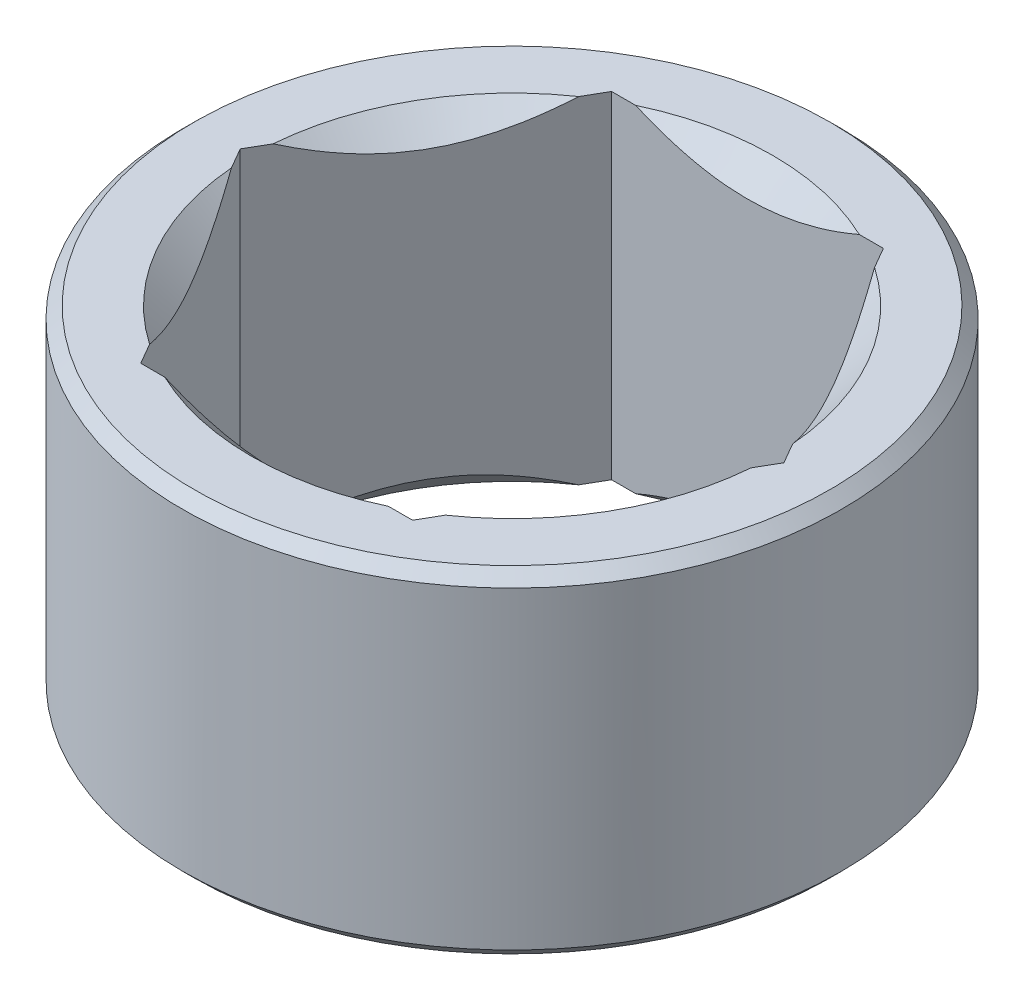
ISO-10303-21;
HEADER;
FILE_DESCRIPTION(('STEP AP214'),'2;1');
FILE_NAME('part.step','',(''),(''),'','','');
FILE_SCHEMA(('AUTOMOTIVE_DESIGN { 1 0 10303 214 1 1 1 1 }'));
ENDSEC;
DATA;
#1=APPLICATION_CONTEXT('core data for automotive mechanical design processes');
#2=APPLICATION_PROTOCOL_DEFINITION('international standard','automotive_design',2000,#1);
#3=PRODUCT_CONTEXT('',#1,'mechanical');
#4=PRODUCT('Part','Part','',(#3));
#5=PRODUCT_RELATED_PRODUCT_CATEGORY('part','',(#4));
#6=PRODUCT_DEFINITION_FORMATION('','',#4);
#7=PRODUCT_DEFINITION_CONTEXT('part definition',#1,'design');
#8=PRODUCT_DEFINITION('design','',#6,#7);
#9=PRODUCT_DEFINITION_SHAPE('','',#8);
#10=(LENGTH_UNIT() NAMED_UNIT(*) SI_UNIT(.MILLI.,.METRE.));
#11=(NAMED_UNIT(*) PLANE_ANGLE_UNIT() SI_UNIT($,.RADIAN.));
#12=(NAMED_UNIT(*) SI_UNIT($,.STERADIAN.) SOLID_ANGLE_UNIT());
#13=UNCERTAINTY_MEASURE_WITH_UNIT(LENGTH_MEASURE(1.E-05),#10,'distance_accuracy_value','');
#14=(GEOMETRIC_REPRESENTATION_CONTEXT(3) GLOBAL_UNCERTAINTY_ASSIGNED_CONTEXT((#13)) GLOBAL_UNIT_ASSIGNED_CONTEXT((#10,
#11,#12)) REPRESENTATION_CONTEXT('',''));
#15=CARTESIAN_POINT('',(0.,0.,0.));
#16=DIRECTION('',(0.,0.,1.));
#17=DIRECTION('',(1.,0.,0.));
#18=AXIS2_PLACEMENT_3D('',#15,#16,#17);
#19=CARTESIAN_POINT('',(3.03108891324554,-3.90512483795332,1.75));
#20=DIRECTION('',(0.866025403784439,0.,0.5));
#21=DIRECTION('',(0.5,0.,-0.866025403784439));
#22=AXIS2_PLACEMENT_3D('',#19,#20,#21);
#23=PLANE('',#22);
#24=DIRECTION('',(0.5,0.,-0.866025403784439));
#25=VECTOR('',#24,1.);
#26=CARTESIAN_POINT('',(3.03108891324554,0.,1.75));
#27=LINE('',#26,#25);
#28=CARTESIAN_POINT('',(2.02072594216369,0.,3.5));
#29=VERTEX_POINT('',#28);
#30=CARTESIAN_POINT('',(2.1995804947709,-3.3738490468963E-12,3.19021482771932));
#31=VERTEX_POINT('',#30);
#32=EDGE_CURVE('E440',#29,#31,#27,.T.);
#33=ORIENTED_EDGE('',*,*,#32,.F.);
#34=DIRECTION('',(0.,1.,0.));
#35=VECTOR('',#34,1.);
#36=CARTESIAN_POINT('',(2.02072594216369,-3.90512483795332,3.5));
#37=LINE('',#36,#35);
#38=CARTESIAN_POINT('',(2.02072594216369,5.,3.5));
#39=VERTEX_POINT('',#38);
#40=EDGE_CURVE('E434',#29,#39,#37,.T.);
#41=ORIENTED_EDGE('',*,*,#40,.T.);
#42=DIRECTION('',(0.5,0.,-0.866025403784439));
#43=VECTOR('',#42,1.);
#44=CARTESIAN_POINT('',(3.03108891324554,5.,1.75));
#45=LINE('',#44,#43);
#46=CARTESIAN_POINT('',(2.19958049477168,4.99999999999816,3.19021482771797));
#47=VERTEX_POINT('',#46);
#48=EDGE_CURVE('E444',#47,#39,#45,.F.);
#49=ORIENTED_EDGE('',*,*,#48,.F.);
#50=CARTESIAN_POINT('',(2.19958049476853,5.00000000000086,3.19021482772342));
#51=CARTESIAN_POINT('',(2.25988384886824,4.94823979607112,3.08576635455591));
#52=CARTESIAN_POINT('',(2.32109270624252,4.90029234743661,2.97974950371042));
#53=CARTESIAN_POINT('',(2.4453953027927,4.81397240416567,2.76445109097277));
#54=CARTESIAN_POINT('',(2.5084947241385,4.77563289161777,2.65515968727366));
#55=CARTESIAN_POINT('',(2.63555957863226,4.71120349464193,2.43507690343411));
#56=CARTESIAN_POINT('',(2.69950855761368,4.68498711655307,2.32431402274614));
#57=CARTESIAN_POINT('',(2.82835908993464,4.64611091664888,2.10113835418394));
#58=CARTESIAN_POINT('',(2.89325917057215,4.63343200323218,1.98872811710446));
#59=CARTESIAN_POINT('',(3.01955537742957,4.62293511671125,1.76997667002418));
#60=CARTESIAN_POINT('',(3.08093424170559,4.62429071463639,1.66366535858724));
#61=CARTESIAN_POINT('',(3.20331050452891,4.63978476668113,1.45170345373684));
#62=CARTESIAN_POINT('',(3.26430769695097,4.65392961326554,1.34605321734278));
#63=CARTESIAN_POINT('',(3.38527889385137,4.69397122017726,1.13652495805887));
#64=CARTESIAN_POINT('',(3.44525336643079,4.7198624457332,1.03264612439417));
#65=CARTESIAN_POINT('',(3.56387400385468,4.78181692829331,0.827189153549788));
#66=CARTESIAN_POINT('',(3.62251979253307,4.81788302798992,0.725611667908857));
#67=CARTESIAN_POINT('',(3.7112413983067,4.87960838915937,0.571941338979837));
#68=CARTESIAN_POINT('',(3.74185591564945,4.90225005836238,0.518915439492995));
#69=CARTESIAN_POINT('',(3.8025799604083,4.94961521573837,0.41373830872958));
#70=CARTESIAN_POINT('',(3.83269067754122,4.97433259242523,0.361585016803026));
#71=CARTESIAN_POINT('',(3.86259733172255,5.00000000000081,0.309785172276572));
#72=B_SPLINE_CURVE_WITH_KNOTS('',3,(#50,#51,#52,#53,#54,#55,#56,#57,#58,#59,#60,#61,#62,#63,#64,
#65,#66,#67,#68,#69,#70,#71),.UNSPECIFIED.,.F.,.F.,(4,2,2,2,2,2,2,2,2,2,4),(0.,
0.393910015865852,0.789154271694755,1.18017591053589,1.57064536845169,1.93825910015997,
2.30605667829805,2.67368113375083,3.04140839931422,3.23721815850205,3.43247035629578),.UNSPECIFIED.);
#73=CARTESIAN_POINT('',(3.8625973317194,4.99999999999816,0.309785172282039));
#74=VERTEX_POINT('',#73);
#75=EDGE_CURVE('E219',#47,#74,#72,.T.);
#76=ORIENTED_EDGE('',*,*,#75,.T.);
#77=DIRECTION('',(0.5,0.,-0.866025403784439));
#78=VECTOR('',#77,1.);
#79=CARTESIAN_POINT('',(3.03108891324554,5.,1.75));
#80=LINE('',#79,#78);
#81=CARTESIAN_POINT('',(4.04145188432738,5.00000000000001,0.));
#82=VERTEX_POINT('',#81);
#83=EDGE_CURVE('E449',#82,#74,#80,.F.);
#84=ORIENTED_EDGE('',*,*,#83,.F.);
#85=DIRECTION('',(0.,1.,0.));
#86=VECTOR('',#85,1.);
#87=CARTESIAN_POINT('',(4.04145188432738,-3.90512483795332,0.));
#88=LINE('',#87,#86);
#89=CARTESIAN_POINT('',(4.04145188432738,0.,0.));
#90=VERTEX_POINT('',#89);
#91=EDGE_CURVE('E359',#82,#90,#88,.F.);
#92=ORIENTED_EDGE('',*,*,#91,.T.);
#93=DIRECTION('',(0.5,0.,-0.866025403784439));
#94=VECTOR('',#93,1.);
#95=CARTESIAN_POINT('',(3.03108891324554,0.,1.75));
#96=LINE('',#95,#94);
#97=CARTESIAN_POINT('',(3.86259733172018,-3.37327958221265E-12,0.309785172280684));
#98=VERTEX_POINT('',#97);
#99=EDGE_CURVE('E357',#98,#90,#96,.T.);
#100=ORIENTED_EDGE('',*,*,#99,.F.);
#101=CARTESIAN_POINT('',(3.86259733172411,-6.74840878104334E-12,0.309785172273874));
#102=CARTESIAN_POINT('',(3.80229397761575,0.051760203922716,0.414233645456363));
#103=CARTESIAN_POINT('',(3.74108512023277,0.0997076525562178,0.520250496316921));
#104=CARTESIAN_POINT('',(3.61678252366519,0.186027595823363,0.735548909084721));
#105=CARTESIAN_POINT('',(3.55368310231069,0.224367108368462,0.844840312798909));
#106=CARTESIAN_POINT('',(3.42661824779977,0.288796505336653,1.06492309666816));
#107=CARTESIAN_POINT('',(3.36266926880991,0.315012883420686,1.17568597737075));
#108=CARTESIAN_POINT('',(3.23381873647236,0.35388908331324,1.39886164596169));
#109=CARTESIAN_POINT('',(3.16891865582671,0.366567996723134,1.51127188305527));
#110=CARTESIAN_POINT('',(3.04262244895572,0.377064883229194,1.73002333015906));
#111=CARTESIAN_POINT('',(2.98124358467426,0.375709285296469,1.83633464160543));
#112=CARTESIAN_POINT('',(2.85886732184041,0.360215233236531,2.04829654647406));
#113=CARTESIAN_POINT('',(2.79787012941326,0.346070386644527,2.15394678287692));
#114=CARTESIAN_POINT('',(2.67689893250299,0.306028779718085,2.36347504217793));
#115=CARTESIAN_POINT('',(2.61692445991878,0.28013755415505,2.46735387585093));
#116=CARTESIAN_POINT('',(2.49830382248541,0.218183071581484,2.67281084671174));
#117=CARTESIAN_POINT('',(2.43965803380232,0.182116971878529,2.7743883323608));
#118=CARTESIAN_POINT('',(2.35093642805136,0.120391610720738,2.92805866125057));
#119=CARTESIAN_POINT('',(2.32032191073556,0.0977499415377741,2.98108456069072));
#120=CARTESIAN_POINT('',(2.25959786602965,0.0503847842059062,3.08626169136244));
#121=CARTESIAN_POINT('',(2.22948714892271,0.0256674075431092,3.13841498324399));
#122=CARTESIAN_POINT('',(2.19958049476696,-6.70526278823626E-12,3.19021482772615));
#123=B_SPLINE_CURVE_WITH_KNOTS('',3,(#101,#102,#103,#104,#105,#106,#107,#108,#109,#110,#111,
#112,#113,#114,#115,#116,#117,#118,#119,#120,#121,#122),.UNSPECIFIED.,.F.,.F.,(4,2,2,2,2,2,2,2,
2,2,4),(0.,0.393910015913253,0.789154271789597,1.18017591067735,1.57064536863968,
1.9382591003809,2.30605667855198,2.67368113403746,3.04140839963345,3.23721815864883,
3.43247035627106),.UNSPECIFIED.);
#124=EDGE_CURVE('E251',#98,#31,#123,.T.);
#125=ORIENTED_EDGE('',*,*,#124,.T.);
#126=EDGE_LOOP('',(#33,#41,#49,#76,#84,#92,#100,#125));
#127=FACE_BOUND('',#126,.T.);
#128=ADVANCED_FACE('F16',(#127),#23,.F.);
#129=CARTESIAN_POINT('',(0.,-3.90512483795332,3.5));
#130=DIRECTION('',(0.,0.,1.));
#131=DIRECTION('',(1.,0.,0.));
#132=AXIS2_PLACEMENT_3D('',#129,#130,#131);
#133=PLANE('',#132);
#134=DIRECTION('',(1.,0.,0.));
#135=VECTOR('',#134,1.);
#136=CARTESIAN_POINT('',(0.,0.,3.5));
#137=LINE('',#136,#135);
#138=CARTESIAN_POINT('',(-2.02072594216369,0.,3.5));
#139=VERTEX_POINT('',#138);
#140=CARTESIAN_POINT('',(-1.66301683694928,-3.37238688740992E-12,3.5));
#141=VERTEX_POINT('',#140);
#142=EDGE_CURVE('E421',#139,#141,#137,.T.);
#143=ORIENTED_EDGE('',*,*,#142,.F.);
#144=DIRECTION('',(0.,1.,0.));
#145=VECTOR('',#144,1.);
#146=CARTESIAN_POINT('',(-2.02072594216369,-3.90512483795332,3.5));
#147=LINE('',#146,#145);
#148=CARTESIAN_POINT('',(-2.02072594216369,5.,3.5));
#149=VERTEX_POINT('',#148);
#150=EDGE_CURVE('E416',#139,#149,#147,.T.);
#151=ORIENTED_EDGE('',*,*,#150,.T.);
#152=DIRECTION('',(1.,0.,0.));
#153=VECTOR('',#152,1.);
#154=CARTESIAN_POINT('',(0.,5.,3.5));
#155=LINE('',#154,#153);
#156=CARTESIAN_POINT('',(-1.66301683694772,4.99999999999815,3.5));
#157=VERTEX_POINT('',#156);
#158=EDGE_CURVE('E425',#157,#149,#155,.F.);
#159=ORIENTED_EDGE('',*,*,#158,.F.);
#160=CARTESIAN_POINT('',(-1.66301683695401,5.00000000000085,3.5));
#161=CARTESIAN_POINT('',(-1.5424101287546,4.94823979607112,3.5));
#162=CARTESIAN_POINT('',(-1.41999241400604,4.90029234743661,3.5));
#163=CARTESIAN_POINT('',(-1.17138722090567,4.81397240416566,3.5));
#164=CARTESIAN_POINT('',(-1.04518837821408,4.77563289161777,3.5));
#165=CARTESIAN_POINT('',(-0.79105866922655,4.71120349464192,3.5));
#166=CARTESIAN_POINT('',(-0.663160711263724,4.68498711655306,3.5));
#167=CARTESIAN_POINT('',(-0.405459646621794,4.64611091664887,3.5));
#168=CARTESIAN_POINT('',(-0.275659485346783,4.63343200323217,3.5));
#169=CARTESIAN_POINT('',(-0.0230670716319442,4.62293511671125,3.5));
#170=CARTESIAN_POINT('',(0.0996906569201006,4.62429071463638,3.5));
#171=CARTESIAN_POINT('',(0.344443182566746,4.63978476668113,3.5));
#172=CARTESIAN_POINT('',(0.466437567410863,4.65392961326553,3.5));
#173=CARTESIAN_POINT('',(0.70837996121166,4.69397122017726,3.5));
#174=CARTESIAN_POINT('',(0.828328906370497,4.71986244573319,3.5));
#175=CARTESIAN_POINT('',(1.06557018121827,4.78181692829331,3.5));
#176=CARTESIAN_POINT('',(1.18286175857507,4.81788302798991,3.5));
#177=CARTESIAN_POINT('',(1.36030497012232,4.87960838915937,3.5));
#178=CARTESIAN_POINT('',(1.42153400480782,4.90225005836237,3.5));
#179=CARTESIAN_POINT('',(1.54298209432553,4.94961521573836,3.5));
#180=CARTESIAN_POINT('',(1.60320352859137,4.97433259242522,3.5));
#181=CARTESIAN_POINT('',(1.66301683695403,5.00000000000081,3.5));
#182=B_SPLINE_CURVE_WITH_KNOTS('',3,(#160,#161,#162,#163,#164,#165,#166,#167,#168,#169,#170,
#171,#172,#173,#174,#175,#176,#177,#178,#179,#180,#181),.UNSPECIFIED.,.F.,.F.,(4,2,2,2,2,2,2,2,
2,2,4),(0.,0.39391001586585,0.789154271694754,1.18017591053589,1.57064536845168,
1.93825910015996,2.30605667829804,2.67368113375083,3.04140839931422,3.23721815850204,
3.43247035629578),.UNSPECIFIED.);
#183=CARTESIAN_POINT('',(1.66301683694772,4.99999999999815,3.5));
#184=VERTEX_POINT('',#183);
#185=EDGE_CURVE('E488',#157,#184,#182,.T.);
#186=ORIENTED_EDGE('',*,*,#185,.T.);
#187=DIRECTION('',(1.,0.,0.));
#188=VECTOR('',#187,1.);
#189=CARTESIAN_POINT('',(0.,5.,3.5));
#190=LINE('',#189,#188);
#191=EDGE_CURVE('E430',#39,#184,#190,.F.);
#192=ORIENTED_EDGE('',*,*,#191,.F.);
#193=ORIENTED_EDGE('',*,*,#40,.F.);
#194=DIRECTION('',(1.,0.,0.));
#195=VECTOR('',#194,1.);
#196=CARTESIAN_POINT('',(0.,0.,3.5));
#197=LINE('',#196,#195);
#198=CARTESIAN_POINT('',(1.66301683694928,-3.37235223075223E-12,3.5));
#199=VERTEX_POINT('',#198);
#200=EDGE_CURVE('E437',#199,#29,#197,.T.);
#201=ORIENTED_EDGE('',*,*,#200,.F.);
#202=CARTESIAN_POINT('',(1.66301683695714,-6.74520497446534E-12,3.5));
#203=CARTESIAN_POINT('',(1.54241012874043,0.0517602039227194,3.5));
#204=CARTESIAN_POINT('',(1.41999241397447,0.099707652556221,3.5));
#205=CARTESIAN_POINT('',(1.17138722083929,0.186027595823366,3.5));
#206=CARTESIAN_POINT('',(1.04518837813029,0.224367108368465,3.5));
#207=CARTESIAN_POINT('',(0.791058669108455,0.288796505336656,3.5));
#208=CARTESIAN_POINT('',(0.663160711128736,0.315012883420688,3.5));
#209=CARTESIAN_POINT('',(0.405459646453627,0.353889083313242,3.5));
#210=CARTESIAN_POINT('',(0.275659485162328,0.366567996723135,3.5));
#211=CARTESIAN_POINT('',(0.0230670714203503,0.377064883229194,3.5));
#212=CARTESIAN_POINT('',(-0.0996906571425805,0.375709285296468,3.5));
#213=CARTESIAN_POINT('',(-0.344443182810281,0.36021523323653,3.5));
#214=CARTESIAN_POINT('',(-0.466437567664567,0.346070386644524,3.5));
#215=CARTESIAN_POINT('',(-0.708379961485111,0.306028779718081,3.5));
#216=CARTESIAN_POINT('',(-0.828328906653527,0.280137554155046,3.5));
#217=CARTESIAN_POINT('',(-1.06557018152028,0.218183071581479,3.5));
#218=CARTESIAN_POINT('',(-1.18286175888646,0.182116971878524,3.5));
#219=CARTESIAN_POINT('',(-1.36030497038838,0.120391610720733,3.5));
#220=CARTESIAN_POINT('',(-1.42153400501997,0.097749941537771,3.5));
#221=CARTESIAN_POINT('',(-1.54298209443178,0.0503847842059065,3.5));
#222=CARTESIAN_POINT('',(-1.60320352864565,0.0256674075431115,3.5));
#223=CARTESIAN_POINT('',(-1.66301683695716,-6.70062350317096E-12,3.5));
#224=B_SPLINE_CURVE_WITH_KNOTS('',3,(#202,#203,#204,#205,#206,#207,#208,#209,#210,#211,#212,
#213,#214,#215,#216,#217,#218,#219,#220,#221,#222,#223),.UNSPECIFIED.,.F.,.F.,(4,2,2,2,2,2,2,2,
2,2,4),(0.,0.393910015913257,0.789154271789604,1.18017591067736,1.5706453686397,
1.93825910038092,2.306056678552,2.67368113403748,3.04140839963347,3.23721815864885,
3.43247035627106),.UNSPECIFIED.);
#225=EDGE_CURVE('E220',#199,#141,#224,.T.);
#226=ORIENTED_EDGE('',*,*,#225,.T.);
#227=EDGE_LOOP('',(#143,#151,#159,#186,#192,#193,#201,#226));
#228=FACE_BOUND('',#227,.T.);
#229=ADVANCED_FACE('F205',(#228),#133,.F.);
#230=CARTESIAN_POINT('',(-3.03108891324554,-3.90512483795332,1.75));
#231=DIRECTION('',(-0.866025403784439,0.,0.5));
#232=DIRECTION('',(0.5,0.,0.866025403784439));
#233=AXIS2_PLACEMENT_3D('',#230,#231,#232);
#234=PLANE('',#233);
#235=DIRECTION('',(0.5,0.,0.866025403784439));
#236=VECTOR('',#235,1.);
#237=CARTESIAN_POINT('',(-3.03108891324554,0.,1.75));
#238=LINE('',#237,#236);
#239=CARTESIAN_POINT('',(-4.04145188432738,0.,0.));
#240=VERTEX_POINT('',#239);
#241=CARTESIAN_POINT('',(-3.86259733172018,-3.37555176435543E-12,0.30978517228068));
#242=VERTEX_POINT('',#241);
#243=EDGE_CURVE('E403',#240,#242,#238,.T.);
#244=ORIENTED_EDGE('',*,*,#243,.F.);
#245=DIRECTION('',(0.,1.,0.));
#246=VECTOR('',#245,1.);
#247=CARTESIAN_POINT('',(-4.04145188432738,-3.90512483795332,0.));
#248=LINE('',#247,#246);
#249=CARTESIAN_POINT('',(-4.04145188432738,5.,0.));
#250=VERTEX_POINT('',#249);
#251=EDGE_CURVE('E399',#240,#250,#248,.T.);
#252=ORIENTED_EDGE('',*,*,#251,.T.);
#253=DIRECTION('',(0.5,0.,0.866025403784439));
#254=VECTOR('',#253,1.);
#255=CARTESIAN_POINT('',(-3.03108891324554,5.,1.75));
#256=LINE('',#255,#254);
#257=CARTESIAN_POINT('',(-3.8625973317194,4.99999999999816,0.309785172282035));
#258=VERTEX_POINT('',#257);
#259=EDGE_CURVE('E407',#258,#250,#256,.F.);
#260=ORIENTED_EDGE('',*,*,#259,.F.);
#261=CARTESIAN_POINT('',(-3.86259733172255,5.00000000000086,0.309785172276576));
#262=CARTESIAN_POINT('',(-3.80229397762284,4.94823979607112,0.414233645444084));
#263=CARTESIAN_POINT('',(-3.74108512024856,4.90029234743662,0.520250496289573));
#264=CARTESIAN_POINT('',(-3.61678252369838,4.81397240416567,0.735548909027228));
#265=CARTESIAN_POINT('',(-3.55368310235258,4.77563289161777,0.84484031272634));
#266=CARTESIAN_POINT('',(-3.42661824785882,4.71120349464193,1.06492309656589));
#267=CARTESIAN_POINT('',(-3.3626692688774,4.68498711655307,1.17568597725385));
#268=CARTESIAN_POINT('',(-3.23381873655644,4.64611091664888,1.39886164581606));
#269=CARTESIAN_POINT('',(-3.16891865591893,4.63343200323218,1.51127188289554));
#270=CARTESIAN_POINT('',(-3.04262244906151,4.62293511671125,1.73002332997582));
#271=CARTESIAN_POINT('',(-2.98124358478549,4.62429071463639,1.83633464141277));
#272=CARTESIAN_POINT('',(-2.85886732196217,4.63978476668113,2.04829654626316));
#273=CARTESIAN_POINT('',(-2.79787012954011,4.65392961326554,2.15394678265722));
#274=CARTESIAN_POINT('',(-2.67689893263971,4.69397122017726,2.36347504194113));
#275=CARTESIAN_POINT('',(-2.61692446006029,4.7198624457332,2.46735387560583));
#276=CARTESIAN_POINT('',(-2.4983038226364,4.78181692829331,2.67281084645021));
#277=CARTESIAN_POINT('',(-2.43965803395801,4.81788302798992,2.77438833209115));
#278=CARTESIAN_POINT('',(-2.35093642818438,4.87960838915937,2.92805866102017));
#279=CARTESIAN_POINT('',(-2.32032191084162,4.90225005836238,2.98108456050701));
#280=CARTESIAN_POINT('',(-2.25959786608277,4.94961521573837,3.08626169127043));
#281=CARTESIAN_POINT('',(-2.22948714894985,4.97433259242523,3.13841498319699));
#282=CARTESIAN_POINT('',(-2.19958049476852,5.00000000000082,3.19021482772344));
#283=B_SPLINE_CURVE_WITH_KNOTS('',3,(#261,#262,#263,#264,#265,#266,#267,#268,#269,#270,#271,
#272,#273,#274,#275,#276,#277,#278,#279,#280,#281,#282),.UNSPECIFIED.,.F.,.F.,(4,2,2,2,2,2,2,2,
2,2,4),(0.,0.393910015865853,0.789154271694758,1.1801759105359,1.57064536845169,
1.93825910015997,2.30605667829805,2.67368113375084,3.04140839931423,3.23721815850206,
3.4324703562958),.UNSPECIFIED.);
#284=CARTESIAN_POINT('',(-2.19958049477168,4.99999999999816,3.19021482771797));
#285=VERTEX_POINT('',#284);
#286=EDGE_CURVE('E190',#258,#285,#283,.T.);
#287=ORIENTED_EDGE('',*,*,#286,.T.);
#288=DIRECTION('',(0.5,0.,0.866025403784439));
#289=VECTOR('',#288,1.);
#290=CARTESIAN_POINT('',(-3.03108891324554,5.,1.75));
#291=LINE('',#290,#289);
#292=EDGE_CURVE('E412',#149,#285,#291,.F.);
#293=ORIENTED_EDGE('',*,*,#292,.F.);
#294=ORIENTED_EDGE('',*,*,#150,.F.);
#295=DIRECTION('',(0.5,0.,0.866025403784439));
#296=VECTOR('',#295,1.);
#297=CARTESIAN_POINT('',(-3.03108891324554,0.,1.75));
#298=LINE('',#297,#296);
#299=CARTESIAN_POINT('',(-2.1995804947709,-3.37625537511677E-12,3.19021482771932));
#300=VERTEX_POINT('',#299);
#301=EDGE_CURVE('E419',#300,#139,#298,.T.);
#302=ORIENTED_EDGE('',*,*,#301,.F.);
#303=CARTESIAN_POINT('',(-2.19958049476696,-6.75440851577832E-12,3.19021482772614));
#304=CARTESIAN_POINT('',(-2.25988384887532,0.051760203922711,3.08576635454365));
#305=CARTESIAN_POINT('',(-2.3210927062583,0.0997076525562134,2.97974950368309));
#306=CARTESIAN_POINT('',(-2.44539530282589,0.18602759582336,2.76445109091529));
#307=CARTESIAN_POINT('',(-2.50849472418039,0.224367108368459,2.6551596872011));
#308=CARTESIAN_POINT('',(-2.6355595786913,0.288796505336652,2.43507690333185));
#309=CARTESIAN_POINT('',(-2.69950855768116,0.315012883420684,2.32431402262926));
#310=CARTESIAN_POINT('',(-2.82835909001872,0.35388908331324,2.10113835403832));
#311=CARTESIAN_POINT('',(-2.89325917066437,0.366567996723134,1.98872811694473));
#312=CARTESIAN_POINT('',(-3.01955537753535,0.377064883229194,1.76997666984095));
#313=CARTESIAN_POINT('',(-3.08093424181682,0.375709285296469,1.66366535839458));
#314=CARTESIAN_POINT('',(-3.20331050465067,0.360215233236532,1.45170345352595));
#315=CARTESIAN_POINT('',(-3.26430769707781,0.346070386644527,1.34605321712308));
#316=CARTESIAN_POINT('',(-3.38527889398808,0.306028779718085,1.13652495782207));
#317=CARTESIAN_POINT('',(-3.44525336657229,0.280137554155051,1.03264612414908));
#318=CARTESIAN_POINT('',(-3.56387400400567,0.218183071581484,0.827189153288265));
#319=CARTESIAN_POINT('',(-3.62251979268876,0.182116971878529,0.725611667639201));
#320=CARTESIAN_POINT('',(-3.71124139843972,0.120391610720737,0.571941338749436));
#321=CARTESIAN_POINT('',(-3.74185591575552,0.0977499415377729,0.518915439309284));
#322=CARTESIAN_POINT('',(-3.80257996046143,0.0503847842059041,0.41373830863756));
#323=CARTESIAN_POINT('',(-3.83269067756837,0.0256674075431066,0.361585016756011));
#324=CARTESIAN_POINT('',(-3.86259733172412,-6.70837451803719E-12,0.309785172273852));
#325=B_SPLINE_CURVE_WITH_KNOTS('',3,(#303,#304,#305,#306,#307,#308,#309,#310,#311,#312,#313,
#314,#315,#316,#317,#318,#319,#320,#321,#322,#323,#324),.UNSPECIFIED.,.F.,.F.,(4,2,2,2,2,2,2,2,
2,2,4),(0.,0.393910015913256,0.789154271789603,1.18017591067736,1.57064536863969,
1.93825910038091,2.30605667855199,2.67368113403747,3.04140839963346,3.23721815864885,
3.43247035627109),.UNSPECIFIED.);
#326=EDGE_CURVE('E210',#300,#242,#325,.T.);
#327=ORIENTED_EDGE('',*,*,#326,.T.);
#328=EDGE_LOOP('',(#244,#252,#260,#287,#293,#294,#302,#327));
#329=FACE_BOUND('',#328,.T.);
#330=ADVANCED_FACE('F200',(#329),#234,.F.);
#331=CARTESIAN_POINT('',(-3.03108891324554,-3.90512483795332,-1.75));
#332=DIRECTION('',(-0.866025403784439,0.,-0.5));
#333=DIRECTION('',(-0.5,0.,0.866025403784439));
#334=AXIS2_PLACEMENT_3D('',#331,#332,#333);
#335=PLANE('',#334);
#336=DIRECTION('',(-0.5,0.,0.866025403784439));
#337=VECTOR('',#336,1.);
#338=CARTESIAN_POINT('',(-3.03108891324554,0.,-1.75));
#339=LINE('',#338,#337);
#340=CARTESIAN_POINT('',(-2.02072594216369,0.,-3.5));
#341=VERTEX_POINT('',#340);
#342=CARTESIAN_POINT('',(-2.1995804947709,-3.37643465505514E-12,-3.19021482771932));
#343=VERTEX_POINT('',#342);
#344=EDGE_CURVE('E121',#341,#343,#339,.T.);
#345=ORIENTED_EDGE('',*,*,#344,.F.);
#346=DIRECTION('',(0.,1.,0.));
#347=VECTOR('',#346,1.);
#348=CARTESIAN_POINT('',(-2.02072594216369,-3.90512483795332,-3.5));
#349=LINE('',#348,#347);
#350=CARTESIAN_POINT('',(-2.02072594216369,5.,-3.5));
#351=VERTEX_POINT('',#350);
#352=EDGE_CURVE('E385',#341,#351,#349,.T.);
#353=ORIENTED_EDGE('',*,*,#352,.T.);
#354=DIRECTION('',(-0.5,0.,0.866025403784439));
#355=VECTOR('',#354,1.);
#356=CARTESIAN_POINT('',(-3.03108891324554,5.,-1.75));
#357=LINE('',#356,#355);
#358=CARTESIAN_POINT('',(-2.19958049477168,4.99999999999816,-3.19021482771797));
#359=VERTEX_POINT('',#358);
#360=EDGE_CURVE('E132',#359,#351,#357,.F.);
#361=ORIENTED_EDGE('',*,*,#360,.F.);
#362=CARTESIAN_POINT('',(-2.19958049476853,5.00000000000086,-3.19021482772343));
#363=CARTESIAN_POINT('',(-2.25988384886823,4.94823979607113,-3.08576635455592));
#364=CARTESIAN_POINT('',(-2.32109270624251,4.90029234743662,-2.97974950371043));
#365=CARTESIAN_POINT('',(-2.4453953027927,4.81397240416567,-2.76445109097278));
#366=CARTESIAN_POINT('',(-2.50849472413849,4.77563289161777,-2.65515968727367));
#367=CARTESIAN_POINT('',(-2.63555957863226,4.71120349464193,-2.43507690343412));
#368=CARTESIAN_POINT('',(-2.69950855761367,4.68498711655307,-2.32431402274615));
#369=CARTESIAN_POINT('',(-2.82835908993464,4.64611091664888,-2.10113835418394));
#370=CARTESIAN_POINT('',(-2.89325917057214,4.63343200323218,-1.98872811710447));
#371=CARTESIAN_POINT('',(-3.01955537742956,4.62293511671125,-1.76997667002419));
#372=CARTESIAN_POINT('',(-3.08093424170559,4.62429071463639,-1.66366535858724));
#373=CARTESIAN_POINT('',(-3.20331050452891,4.63978476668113,-1.45170345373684));
#374=CARTESIAN_POINT('',(-3.26430769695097,4.65392961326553,-1.34605321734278));
#375=CARTESIAN_POINT('',(-3.38527889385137,4.69397122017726,-1.13652495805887));
#376=CARTESIAN_POINT('',(-3.44525336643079,4.7198624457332,-1.03264612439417));
#377=CARTESIAN_POINT('',(-3.56387400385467,4.78181692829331,-0.827189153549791));
#378=CARTESIAN_POINT('',(-3.62251979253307,4.81788302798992,-0.72561166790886));
#379=CARTESIAN_POINT('',(-3.7112413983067,4.87960838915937,-0.571941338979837));
#380=CARTESIAN_POINT('',(-3.74185591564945,4.90225005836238,-0.518915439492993));
#381=CARTESIAN_POINT('',(-3.8025799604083,4.94961521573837,-0.413738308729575));
#382=CARTESIAN_POINT('',(-3.83269067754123,4.97433259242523,-0.361585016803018));
#383=CARTESIAN_POINT('',(-3.86259733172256,5.00000000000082,-0.309785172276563));
#384=B_SPLINE_CURVE_WITH_KNOTS('',3,(#362,#363,#364,#365,#366,#367,#368,#369,#370,#371,#372,
#373,#374,#375,#376,#377,#378,#379,#380,#381,#382,#383),.UNSPECIFIED.,.F.,.F.,(4,2,2,2,2,2,2,2,
2,2,4),(0.,0.393910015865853,0.789154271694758,1.1801759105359,1.57064536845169,
1.93825910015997,2.30605667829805,2.67368113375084,3.04140839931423,3.23721815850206,
3.43247035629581),.UNSPECIFIED.);
#385=CARTESIAN_POINT('',(-3.8625973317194,4.99999999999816,-0.309785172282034));
#386=VERTEX_POINT('',#385);
#387=EDGE_CURVE('E183',#359,#386,#384,.T.);
#388=ORIENTED_EDGE('',*,*,#387,.T.);
#389=DIRECTION('',(-0.5,0.,0.866025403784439));
#390=VECTOR('',#389,1.);
#391=CARTESIAN_POINT('',(-3.03108891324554,5.,-1.75));
#392=LINE('',#391,#390);
#393=EDGE_CURVE('E395',#250,#386,#392,.F.);
#394=ORIENTED_EDGE('',*,*,#393,.F.);
#395=ORIENTED_EDGE('',*,*,#251,.F.);
#396=DIRECTION('',(-0.5,0.,0.866025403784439));
#397=VECTOR('',#396,1.);
#398=CARTESIAN_POINT('',(-3.03108891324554,0.,-1.75));
#399=LINE('',#398,#397);
#400=CARTESIAN_POINT('',(-3.86259733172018,-3.37596011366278E-12,-0.309785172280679));
#401=VERTEX_POINT('',#400);
#402=EDGE_CURVE('E114',#401,#240,#399,.T.);
#403=ORIENTED_EDGE('',*,*,#402,.F.);
#404=CARTESIAN_POINT('',(-3.86259733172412,-6.75366592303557E-12,-0.309785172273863));
#405=CARTESIAN_POINT('',(-3.80229397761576,0.0517602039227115,-0.414233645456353));
#406=CARTESIAN_POINT('',(-3.74108512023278,0.0997076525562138,-0.520250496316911));
#407=CARTESIAN_POINT('',(-3.61678252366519,0.18602759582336,-0.735548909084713));
#408=CARTESIAN_POINT('',(-3.55368310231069,0.22436710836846,-0.844840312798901));
#409=CARTESIAN_POINT('',(-3.42661824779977,0.288796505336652,-1.06492309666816));
#410=CARTESIAN_POINT('',(-3.36266926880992,0.315012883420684,-1.17568597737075));
#411=CARTESIAN_POINT('',(-3.23381873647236,0.35388908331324,-1.39886164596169));
#412=CARTESIAN_POINT('',(-3.16891865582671,0.366567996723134,-1.51127188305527));
#413=CARTESIAN_POINT('',(-3.04262244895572,0.377064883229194,-1.73002333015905));
#414=CARTESIAN_POINT('',(-2.98124358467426,0.375709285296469,-1.83633464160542));
#415=CARTESIAN_POINT('',(-2.85886732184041,0.360215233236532,-2.04829654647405));
#416=CARTESIAN_POINT('',(-2.79787012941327,0.346070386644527,-2.15394678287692));
#417=CARTESIAN_POINT('',(-2.67689893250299,0.306028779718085,-2.36347504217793));
#418=CARTESIAN_POINT('',(-2.61692445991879,0.280137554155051,-2.46735387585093));
#419=CARTESIAN_POINT('',(-2.49830382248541,0.218183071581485,-2.67281084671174));
#420=CARTESIAN_POINT('',(-2.43965803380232,0.182116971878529,-2.7743883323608));
#421=CARTESIAN_POINT('',(-2.35093642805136,0.120391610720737,-2.92805866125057));
#422=CARTESIAN_POINT('',(-2.32032191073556,0.0977499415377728,-2.98108456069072));
#423=CARTESIAN_POINT('',(-2.25959786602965,0.0503847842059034,-3.08626169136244));
#424=CARTESIAN_POINT('',(-2.22948714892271,0.0256674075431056,-3.13841498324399));
#425=CARTESIAN_POINT('',(-2.19958049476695,-6.70987304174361E-12,-3.19021482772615));
#426=B_SPLINE_CURVE_WITH_KNOTS('',3,(#404,#405,#406,#407,#408,#409,#410,#411,#412,#413,#414,
#415,#416,#417,#418,#419,#420,#421,#422,#423,#424,#425),.UNSPECIFIED.,.F.,.F.,(4,2,2,2,2,2,2,2,
2,2,4),(0.,0.393910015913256,0.789154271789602,1.18017591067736,1.57064536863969,
1.93825910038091,2.30605667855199,2.67368113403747,3.04140839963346,3.23721815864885,
3.43247035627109),.UNSPECIFIED.);
#427=EDGE_CURVE('E20',#401,#343,#426,.T.);
#428=ORIENTED_EDGE('',*,*,#427,.T.);
#429=EDGE_LOOP('',(#345,#353,#361,#388,#394,#395,#403,#428));
#430=FACE_BOUND('',#429,.T.);
#431=ADVANCED_FACE('F134',(#430),#335,.F.);
#432=CARTESIAN_POINT('',(0.,-3.90512483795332,-3.5));
#433=DIRECTION('',(0.,0.,-1.));
#434=DIRECTION('',(-1.,0.,0.));
#435=AXIS2_PLACEMENT_3D('',#432,#433,#434);
#436=PLANE('',#435);
#437=DIRECTION('',(-1.,0.,0.));
#438=VECTOR('',#437,1.);
#439=CARTESIAN_POINT('',(0.,0.,-3.5));
#440=LINE('',#439,#438);
#441=CARTESIAN_POINT('',(2.02072594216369,0.,-3.5));
#442=VERTEX_POINT('',#441);
#443=CARTESIAN_POINT('',(1.66301683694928,-3.37238688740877E-12,-3.5));
#444=VERTEX_POINT('',#443);
#445=EDGE_CURVE('E365',#442,#444,#440,.T.);
#446=ORIENTED_EDGE('',*,*,#445,.F.);
#447=DIRECTION('',(0.,1.,0.));
#448=VECTOR('',#447,1.);
#449=CARTESIAN_POINT('',(2.02072594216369,-3.90512483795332,-3.5));
#450=LINE('',#449,#448);
#451=CARTESIAN_POINT('',(2.02072594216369,5.,-3.5));
#452=VERTEX_POINT('',#451);
#453=EDGE_CURVE('E364',#442,#452,#450,.T.);
#454=ORIENTED_EDGE('',*,*,#453,.T.);
#455=DIRECTION('',(-1.,0.,0.));
#456=VECTOR('',#455,1.);
#457=CARTESIAN_POINT('',(0.,5.,-3.5));
#458=LINE('',#457,#456);
#459=CARTESIAN_POINT('',(1.66301683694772,4.99999999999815,-3.5));
#460=VERTEX_POINT('',#459);
#461=EDGE_CURVE('E369',#460,#452,#458,.F.);
#462=ORIENTED_EDGE('',*,*,#461,.F.);
#463=CARTESIAN_POINT('',(1.66301683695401,5.00000000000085,-3.5));
#464=CARTESIAN_POINT('',(1.5424101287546,4.94823979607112,-3.5));
#465=CARTESIAN_POINT('',(1.41999241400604,4.90029234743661,-3.5));
#466=CARTESIAN_POINT('',(1.17138722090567,4.81397240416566,-3.5));
#467=CARTESIAN_POINT('',(1.04518837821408,4.77563289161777,-3.5));
#468=CARTESIAN_POINT('',(0.79105866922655,4.71120349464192,-3.5));
#469=CARTESIAN_POINT('',(0.663160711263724,4.68498711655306,-3.5));
#470=CARTESIAN_POINT('',(0.405459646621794,4.64611091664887,-3.5));
#471=CARTESIAN_POINT('',(0.275659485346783,4.63343200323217,-3.5));
#472=CARTESIAN_POINT('',(0.0230670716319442,4.62293511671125,-3.5));
#473=CARTESIAN_POINT('',(-0.0996906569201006,4.62429071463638,-3.5));
#474=CARTESIAN_POINT('',(-0.344443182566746,4.63978476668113,-3.5));
#475=CARTESIAN_POINT('',(-0.466437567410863,4.65392961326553,-3.5));
#476=CARTESIAN_POINT('',(-0.70837996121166,4.69397122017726,-3.5));
#477=CARTESIAN_POINT('',(-0.828328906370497,4.71986244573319,-3.5));
#478=CARTESIAN_POINT('',(-1.06557018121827,4.78181692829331,-3.5));
#479=CARTESIAN_POINT('',(-1.18286175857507,4.81788302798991,-3.5));
#480=CARTESIAN_POINT('',(-1.36030497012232,4.87960838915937,-3.5));
#481=CARTESIAN_POINT('',(-1.42153400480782,4.90225005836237,-3.5));
#482=CARTESIAN_POINT('',(-1.54298209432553,4.94961521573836,-3.5));
#483=CARTESIAN_POINT('',(-1.60320352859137,4.97433259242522,-3.5));
#484=CARTESIAN_POINT('',(-1.66301683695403,5.00000000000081,-3.5));
#485=B_SPLINE_CURVE_WITH_KNOTS('',3,(#463,#464,#465,#466,#467,#468,#469,#470,#471,#472,#473,
#474,#475,#476,#477,#478,#479,#480,#481,#482,#483,#484),.UNSPECIFIED.,.F.,.F.,(4,2,2,2,2,2,2,2,
2,2,4),(0.,0.39391001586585,0.789154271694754,1.18017591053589,1.57064536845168,
1.93825910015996,2.30605667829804,2.67368113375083,3.04140839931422,3.23721815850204,
3.43247035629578),.UNSPECIFIED.);
#486=CARTESIAN_POINT('',(-1.66301683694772,4.99999999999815,-3.5));
#487=VERTEX_POINT('',#486);
#488=EDGE_CURVE('E145',#460,#487,#485,.T.);
#489=ORIENTED_EDGE('',*,*,#488,.T.);
#490=DIRECTION('',(-1.,0.,0.));
#491=VECTOR('',#490,1.);
#492=CARTESIAN_POINT('',(0.,5.,-3.5));
#493=LINE('',#492,#491);
#494=EDGE_CURVE('E381',#351,#487,#493,.F.);
#495=ORIENTED_EDGE('',*,*,#494,.F.);
#496=ORIENTED_EDGE('',*,*,#352,.F.);
#497=DIRECTION('',(-1.,0.,0.));
#498=VECTOR('',#497,1.);
#499=CARTESIAN_POINT('',(0.,0.,-3.5));
#500=LINE('',#499,#498);
#501=CARTESIAN_POINT('',(-1.66301683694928,-3.37235223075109E-12,-3.5));
#502=VERTEX_POINT('',#501);
#503=EDGE_CURVE('E129',#502,#341,#500,.T.);
#504=ORIENTED_EDGE('',*,*,#503,.F.);
#505=CARTESIAN_POINT('',(-1.66301683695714,-6.74520497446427E-12,-3.5));
#506=CARTESIAN_POINT('',(-1.54241012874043,0.0517602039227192,-3.5));
#507=CARTESIAN_POINT('',(-1.41999241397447,0.0997076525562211,-3.5));
#508=CARTESIAN_POINT('',(-1.17138722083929,0.186027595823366,-3.5));
#509=CARTESIAN_POINT('',(-1.0451883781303,0.224367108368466,-3.5));
#510=CARTESIAN_POINT('',(-0.791058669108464,0.288796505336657,-3.5));
#511=CARTESIAN_POINT('',(-0.663160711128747,0.315012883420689,-3.5));
#512=CARTESIAN_POINT('',(-0.40545964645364,0.353889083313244,-3.5));
#513=CARTESIAN_POINT('',(-0.275659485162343,0.366567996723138,-3.5));
#514=CARTESIAN_POINT('',(-0.0230670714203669,0.377064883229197,-3.5));
#515=CARTESIAN_POINT('',(0.0996906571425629,0.375709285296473,-3.5));
#516=CARTESIAN_POINT('',(0.344443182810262,0.360215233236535,-3.5));
#517=CARTESIAN_POINT('',(0.466437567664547,0.34607038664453,-3.5));
#518=CARTESIAN_POINT('',(0.708379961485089,0.306028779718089,-3.5));
#519=CARTESIAN_POINT('',(0.828328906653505,0.280137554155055,-3.5));
#520=CARTESIAN_POINT('',(1.06557018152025,0.218183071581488,-3.5));
#521=CARTESIAN_POINT('',(1.18286175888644,0.182116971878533,-3.5));
#522=CARTESIAN_POINT('',(1.36030497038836,0.120391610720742,-3.5));
#523=CARTESIAN_POINT('',(1.42153400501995,0.0977499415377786,-3.5));
#524=CARTESIAN_POINT('',(1.54298209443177,0.0503847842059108,-3.5));
#525=CARTESIAN_POINT('',(1.60320352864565,0.0256674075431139,-3.5));
#526=CARTESIAN_POINT('',(1.66301683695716,-6.70064111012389E-12,-3.5));
#527=B_SPLINE_CURVE_WITH_KNOTS('',3,(#505,#506,#507,#508,#509,#510,#511,#512,#513,#514,#515,
#516,#517,#518,#519,#520,#521,#522,#523,#524,#525,#526),.UNSPECIFIED.,.F.,.F.,(4,2,2,2,2,2,2,2,
2,2,4),(0.,0.393910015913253,0.789154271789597,1.18017591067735,1.57064536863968,
1.9382591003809,2.30605667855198,2.67368113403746,3.04140839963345,3.23721815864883,
3.43247035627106),.UNSPECIFIED.);
#528=EDGE_CURVE('E136',#502,#444,#527,.T.);
#529=ORIENTED_EDGE('',*,*,#528,.T.);
#530=EDGE_LOOP('',(#446,#454,#462,#489,#495,#496,#504,#529));
#531=FACE_BOUND('',#530,.T.);
#532=ADVANCED_FACE('F199',(#531),#436,.F.);
#533=CARTESIAN_POINT('',(3.03108891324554,-3.90512483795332,-1.75));
#534=DIRECTION('',(0.866025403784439,0.,-0.5));
#535=DIRECTION('',(-0.5,0.,-0.866025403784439));
#536=AXIS2_PLACEMENT_3D('',#533,#534,#535);
#537=PLANE('',#536);
#538=DIRECTION('',(-0.5,0.,-0.866025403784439));
#539=VECTOR('',#538,1.);
#540=CARTESIAN_POINT('',(3.03108891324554,0.,-1.75));
#541=LINE('',#540,#539);
#542=CARTESIAN_POINT('',(3.86259733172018,-3.37320126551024E-12,-0.309785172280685));
#543=VERTEX_POINT('',#542);
#544=EDGE_CURVE('E137',#90,#543,#541,.T.);
#545=ORIENTED_EDGE('',*,*,#544,.F.);
#546=ORIENTED_EDGE('',*,*,#91,.F.);
#547=DIRECTION('',(-0.5,0.,-0.866025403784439));
#548=VECTOR('',#547,1.);
#549=CARTESIAN_POINT('',(3.03108891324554,5.,-1.75));
#550=LINE('',#549,#548);
#551=CARTESIAN_POINT('',(3.86259733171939,4.99999999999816,-0.309785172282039));
#552=VERTEX_POINT('',#551);
#553=EDGE_CURVE('E41',#552,#82,#550,.F.);
#554=ORIENTED_EDGE('',*,*,#553,.F.);
#555=CARTESIAN_POINT('',(3.86259733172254,5.00000000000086,-0.309785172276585));
#556=CARTESIAN_POINT('',(3.80229397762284,4.94823979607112,-0.414233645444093));
#557=CARTESIAN_POINT('',(3.74108512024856,4.90029234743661,-0.520250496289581));
#558=CARTESIAN_POINT('',(3.61678252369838,4.81397240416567,-0.735548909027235));
#559=CARTESIAN_POINT('',(3.55368310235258,4.77563289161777,-0.844840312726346));
#560=CARTESIAN_POINT('',(3.42661824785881,4.71120349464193,-1.0649230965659));
#561=CARTESIAN_POINT('',(3.3626692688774,4.68498711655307,-1.17568597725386));
#562=CARTESIAN_POINT('',(3.23381873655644,4.64611091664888,-1.39886164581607));
#563=CARTESIAN_POINT('',(3.16891865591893,4.63343200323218,-1.51127188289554));
#564=CARTESIAN_POINT('',(3.04262244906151,4.62293511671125,-1.73002332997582));
#565=CARTESIAN_POINT('',(2.98124358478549,4.62429071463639,-1.83633464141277));
#566=CARTESIAN_POINT('',(2.85886732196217,4.63978476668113,-2.04829654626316));
#567=CARTESIAN_POINT('',(2.79787012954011,4.65392961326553,-2.15394678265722));
#568=CARTESIAN_POINT('',(2.67689893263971,4.69397122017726,-2.36347504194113));
#569=CARTESIAN_POINT('',(2.61692446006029,4.7198624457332,-2.46735387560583));
#570=CARTESIAN_POINT('',(2.4983038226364,4.78181692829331,-2.67281084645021));
#571=CARTESIAN_POINT('',(2.43965803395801,4.81788302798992,-2.77438833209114));
#572=CARTESIAN_POINT('',(2.35093642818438,4.87960838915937,-2.92805866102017));
#573=CARTESIAN_POINT('',(2.32032191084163,4.90225005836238,-2.98108456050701));
#574=CARTESIAN_POINT('',(2.25959786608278,4.94961521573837,-3.08626169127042));
#575=CARTESIAN_POINT('',(2.22948714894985,4.97433259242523,-3.13841498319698));
#576=CARTESIAN_POINT('',(2.19958049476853,5.00000000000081,-3.19021482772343));
#577=B_SPLINE_CURVE_WITH_KNOTS('',3,(#555,#556,#557,#558,#559,#560,#561,#562,#563,#564,#565,
#566,#567,#568,#569,#570,#571,#572,#573,#574,#575,#576),.UNSPECIFIED.,.F.,.F.,(4,2,2,2,2,2,2,2,
2,2,4),(0.,0.39391001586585,0.789154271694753,1.18017591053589,1.57064536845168,
1.93825910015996,2.30605667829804,2.67368113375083,3.04140839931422,3.23721815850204,
3.43247035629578),.UNSPECIFIED.);
#578=CARTESIAN_POINT('',(2.19958049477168,4.99999999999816,-3.19021482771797));
#579=VERTEX_POINT('',#578);
#580=EDGE_CURVE('E140',#552,#579,#577,.T.);
#581=ORIENTED_EDGE('',*,*,#580,.T.);
#582=DIRECTION('',(-0.5,0.,-0.866025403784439));
#583=VECTOR('',#582,1.);
#584=CARTESIAN_POINT('',(3.03108891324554,5.,-1.75));
#585=LINE('',#584,#583);
#586=EDGE_CURVE('E367',#452,#579,#585,.F.);
#587=ORIENTED_EDGE('',*,*,#586,.F.);
#588=ORIENTED_EDGE('',*,*,#453,.F.);
#589=DIRECTION('',(-0.5,0.,-0.866025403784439));
#590=VECTOR('',#589,1.);
#591=CARTESIAN_POINT('',(3.03108891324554,0.,-1.75));
#592=LINE('',#591,#590);
#593=CARTESIAN_POINT('',(2.1995804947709,-3.37385871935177E-12,-3.19021482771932));
#594=VERTEX_POINT('',#593);
#595=EDGE_CURVE('E352',#594,#442,#592,.T.);
#596=ORIENTED_EDGE('',*,*,#595,.F.);
#597=CARTESIAN_POINT('',(2.19958049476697,-6.74977750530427E-12,-3.19021482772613));
#598=CARTESIAN_POINT('',(2.25988384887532,0.0517602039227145,-3.08576635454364));
#599=CARTESIAN_POINT('',(2.3210927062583,0.0997076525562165,-2.97974950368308));
#600=CARTESIAN_POINT('',(2.44539530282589,0.186027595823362,-2.76445109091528));
#601=CARTESIAN_POINT('',(2.50849472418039,0.224367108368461,-2.6551596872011));
#602=CARTESIAN_POINT('',(2.63555957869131,0.288796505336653,-2.43507690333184));
#603=CARTESIAN_POINT('',(2.69950855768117,0.315012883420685,-2.32431402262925));
#604=CARTESIAN_POINT('',(2.82835909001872,0.35388908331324,-2.10113835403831));
#605=CARTESIAN_POINT('',(2.89325917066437,0.366567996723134,-1.98872811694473));
#606=CARTESIAN_POINT('',(3.01955537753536,0.377064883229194,-1.76997666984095));
#607=CARTESIAN_POINT('',(3.08093424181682,0.375709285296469,-1.66366535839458));
#608=CARTESIAN_POINT('',(3.20331050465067,0.360215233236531,-1.45170345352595));
#609=CARTESIAN_POINT('',(3.26430769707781,0.346070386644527,-1.34605321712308));
#610=CARTESIAN_POINT('',(3.38527889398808,0.306028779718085,-1.13652495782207));
#611=CARTESIAN_POINT('',(3.44525336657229,0.28013755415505,-1.03264612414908));
#612=CARTESIAN_POINT('',(3.56387400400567,0.218183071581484,-0.827189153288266));
#613=CARTESIAN_POINT('',(3.62251979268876,0.18211697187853,-0.725611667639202));
#614=CARTESIAN_POINT('',(3.71124139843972,0.120391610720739,-0.571941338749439));
#615=CARTESIAN_POINT('',(3.74185591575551,0.0977499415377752,-0.518915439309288));
#616=CARTESIAN_POINT('',(3.80257996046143,0.0503847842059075,-0.413738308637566));
#617=CARTESIAN_POINT('',(3.83269067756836,0.0256674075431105,-0.361585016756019));
#618=CARTESIAN_POINT('',(3.86259733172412,-6.70404431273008E-12,-0.309785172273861));
#619=B_SPLINE_CURVE_WITH_KNOTS('',3,(#597,#598,#599,#600,#601,#602,#603,#604,#605,#606,#607,
#608,#609,#610,#611,#612,#613,#614,#615,#616,#617,#618),.UNSPECIFIED.,.F.,.F.,(4,2,2,2,2,2,2,2,
2,2,4),(0.,0.393910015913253,0.789154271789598,1.18017591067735,1.57064536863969,
1.9382591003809,2.30605667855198,2.67368113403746,3.04140839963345,3.23721815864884,
3.43247035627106),.UNSPECIFIED.);
#620=EDGE_CURVE('E258',#594,#543,#619,.T.);
#621=ORIENTED_EDGE('',*,*,#620,.T.);
#622=EDGE_LOOP('',(#545,#546,#554,#581,#587,#588,#596,#621));
#623=FACE_BOUND('',#622,.T.);
#624=ADVANCED_FACE('F162',(#623),#537,.F.);
#625=CARTESIAN_POINT('',(0.,-1.13686837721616E-10,0.));
#626=DIRECTION('',(0.,-1.,0.));
#627=DIRECTION('',(0.,0.,-1.));
#628=AXIS2_PLACEMENT_3D('',#625,#626,#627);
#629=CONICAL_SURFACE('',#628,3.87500000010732,0.785398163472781);
#630=CARTESIAN_POINT('',(0.,0.,0.));
#631=DIRECTION('',(0.,-1.,0.));
#632=DIRECTION('',(0.,0.,-1.));
#633=AXIS2_PLACEMENT_3D('',#630,#631,#632);
#634=CIRCLE('',#633,3.87499999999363);
#635=EDGE_CURVE('E126',#401,#343,#634,.T.);
#636=ORIENTED_EDGE('',*,*,#635,.T.);
#637=ORIENTED_EDGE('',*,*,#427,.F.);
#638=EDGE_LOOP('',(#636,#637));
#639=FACE_BOUND('',#638,.T.);
#640=ADVANCED_FACE('F138',(#639),#629,.F.);
#641=CARTESIAN_POINT('',(0.,-1.13686837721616E-10,0.));
#642=DIRECTION('',(0.,-1.,0.));
#643=DIRECTION('',(0.,0.,-1.));
#644=AXIS2_PLACEMENT_3D('',#641,#642,#643);
#645=CONICAL_SURFACE('',#644,3.87500000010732,0.785398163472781);
#646=CARTESIAN_POINT('',(0.,0.,0.));
#647=DIRECTION('',(0.,-1.,0.));
#648=DIRECTION('',(0.,0.,-1.));
#649=AXIS2_PLACEMENT_3D('',#646,#647,#648);
#650=CIRCLE('',#649,3.87499999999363);
#651=EDGE_CURVE('E139',#502,#444,#650,.T.);
#652=ORIENTED_EDGE('',*,*,#651,.T.);
#653=ORIENTED_EDGE('',*,*,#528,.F.);
#654=EDGE_LOOP('',(#652,#653));
#655=FACE_BOUND('',#654,.T.);
#656=ADVANCED_FACE('F269',(#655),#645,.F.);
#657=CARTESIAN_POINT('',(0.,-1.13686837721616E-10,0.));
#658=DIRECTION('',(0.,-1.,0.));
#659=DIRECTION('',(0.,0.,-1.));
#660=AXIS2_PLACEMENT_3D('',#657,#658,#659);
#661=CONICAL_SURFACE('',#660,3.87500000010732,0.785398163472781);
#662=CARTESIAN_POINT('',(0.,0.,0.));
#663=DIRECTION('',(0.,-1.,0.));
#664=DIRECTION('',(0.,0.,-1.));
#665=AXIS2_PLACEMENT_3D('',#662,#663,#664);
#666=CIRCLE('',#665,3.87499999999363);
#667=EDGE_CURVE('E143',#594,#543,#666,.T.);
#668=ORIENTED_EDGE('',*,*,#667,.T.);
#669=ORIENTED_EDGE('',*,*,#620,.F.);
#670=EDGE_LOOP('',(#668,#669));
#671=FACE_BOUND('',#670,.T.);
#672=ADVANCED_FACE('F247',(#671),#661,.F.);
#673=CARTESIAN_POINT('',(0.,-1.13686837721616E-10,0.));
#674=DIRECTION('',(0.,-1.,0.));
#675=DIRECTION('',(0.,0.,-1.));
#676=AXIS2_PLACEMENT_3D('',#673,#674,#675);
#677=CONICAL_SURFACE('',#676,3.87500000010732,0.785398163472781);
#678=CARTESIAN_POINT('',(0.,0.,0.));
#679=DIRECTION('',(0.,-1.,0.));
#680=DIRECTION('',(0.,0.,-1.));
#681=AXIS2_PLACEMENT_3D('',#678,#679,#680);
#682=CIRCLE('',#681,3.87499999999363);
#683=EDGE_CURVE('E344',#98,#31,#682,.T.);
#684=ORIENTED_EDGE('',*,*,#683,.T.);
#685=ORIENTED_EDGE('',*,*,#124,.F.);
#686=EDGE_LOOP('',(#684,#685));
#687=FACE_BOUND('',#686,.T.);
#688=ADVANCED_FACE('F242',(#687),#677,.F.);
#689=CARTESIAN_POINT('',(0.,-1.13686837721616E-10,0.));
#690=DIRECTION('',(0.,-1.,0.));
#691=DIRECTION('',(0.,0.,-1.));
#692=AXIS2_PLACEMENT_3D('',#689,#690,#691);
#693=CONICAL_SURFACE('',#692,3.87500000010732,0.785398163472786);
#694=CARTESIAN_POINT('',(0.,0.,0.));
#695=DIRECTION('',(0.,-1.,0.));
#696=DIRECTION('',(0.,0.,-1.));
#697=AXIS2_PLACEMENT_3D('',#694,#695,#696);
#698=CIRCLE('',#697,3.87499999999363);
#699=EDGE_CURVE('E341',#199,#141,#698,.T.);
#700=ORIENTED_EDGE('',*,*,#699,.T.);
#701=ORIENTED_EDGE('',*,*,#225,.F.);
#702=EDGE_LOOP('',(#700,#701));
#703=FACE_BOUND('',#702,.T.);
#704=ADVANCED_FACE('F236',(#703),#693,.F.);
#705=CARTESIAN_POINT('',(0.,-1.13686837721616E-10,0.));
#706=DIRECTION('',(0.,-1.,0.));
#707=DIRECTION('',(0.,0.,-1.));
#708=AXIS2_PLACEMENT_3D('',#705,#706,#707);
#709=CONICAL_SURFACE('',#708,3.87500000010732,0.785398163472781);
#710=CARTESIAN_POINT('',(0.,0.,0.));
#711=DIRECTION('',(0.,-1.,0.));
#712=DIRECTION('',(0.,0.,-1.));
#713=AXIS2_PLACEMENT_3D('',#710,#711,#712);
#714=CIRCLE('',#713,3.87499999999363);
#715=EDGE_CURVE('E338',#300,#242,#714,.T.);
#716=ORIENTED_EDGE('',*,*,#715,.T.);
#717=ORIENTED_EDGE('',*,*,#326,.F.);
#718=EDGE_LOOP('',(#716,#717));
#719=FACE_BOUND('',#718,.T.);
#720=ADVANCED_FACE('F232',(#719),#709,.F.);
#721=CARTESIAN_POINT('',(0.,4.99999999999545,0.));
#722=DIRECTION('',(0.,1.,0.));
#723=DIRECTION('',(0.,0.,1.));
#724=AXIS2_PLACEMENT_3D('',#721,#722,#723);
#725=CONICAL_SURFACE('',#724,3.87499999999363,0.785398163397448);
#726=ORIENTED_EDGE('',*,*,#75,.F.);
#727=CARTESIAN_POINT('',(0.,4.99999999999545,0.));
#728=DIRECTION('',(0.,1.,0.));
#729=DIRECTION('',(0.,0.,1.));
#730=AXIS2_PLACEMENT_3D('',#727,#728,#729);
#731=CIRCLE('',#730,3.87499999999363);
#732=EDGE_CURVE('E335',#74,#47,#731,.F.);
#733=ORIENTED_EDGE('',*,*,#732,.F.);
#734=EDGE_LOOP('',(#726,#733));
#735=FACE_BOUND('',#734,.T.);
#736=ADVANCED_FACE('F235',(#735),#725,.F.);
#737=CARTESIAN_POINT('',(0.,4.99999999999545,0.));
#738=DIRECTION('',(0.,1.,0.));
#739=DIRECTION('',(0.,0.,1.));
#740=AXIS2_PLACEMENT_3D('',#737,#738,#739);
#741=CONICAL_SURFACE('',#740,3.87499999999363,0.785398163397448);
#742=CARTESIAN_POINT('',(0.,4.99999999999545,0.));
#743=DIRECTION('',(0.,1.,0.));
#744=DIRECTION('',(0.,0.,1.));
#745=AXIS2_PLACEMENT_3D('',#742,#743,#744);
#746=CIRCLE('',#745,3.87499999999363);
#747=EDGE_CURVE('E332',#184,#157,#746,.F.);
#748=ORIENTED_EDGE('',*,*,#747,.F.);
#749=ORIENTED_EDGE('',*,*,#185,.F.);
#750=EDGE_LOOP('',(#748,#749));
#751=FACE_BOUND('',#750,.T.);
#752=ADVANCED_FACE('F497',(#751),#741,.F.);
#753=CARTESIAN_POINT('',(0.,4.99999999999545,0.));
#754=DIRECTION('',(0.,1.,0.));
#755=DIRECTION('',(0.,0.,1.));
#756=AXIS2_PLACEMENT_3D('',#753,#754,#755);
#757=CONICAL_SURFACE('',#756,3.87499999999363,0.785398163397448);
#758=ORIENTED_EDGE('',*,*,#286,.F.);
#759=CARTESIAN_POINT('',(0.,4.99999999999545,0.));
#760=DIRECTION('',(0.,1.,0.));
#761=DIRECTION('',(0.,0.,1.));
#762=AXIS2_PLACEMENT_3D('',#759,#760,#761);
#763=CIRCLE('',#762,3.87499999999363);
#764=EDGE_CURVE('E329',#285,#258,#763,.F.);
#765=ORIENTED_EDGE('',*,*,#764,.F.);
#766=EDGE_LOOP('',(#758,#765));
#767=FACE_BOUND('',#766,.T.);
#768=ADVANCED_FACE('F179',(#767),#757,.F.);
#769=CARTESIAN_POINT('',(0.,4.99999999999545,0.));
#770=DIRECTION('',(0.,1.,0.));
#771=DIRECTION('',(0.,0.,1.));
#772=AXIS2_PLACEMENT_3D('',#769,#770,#771);
#773=CONICAL_SURFACE('',#772,3.87499999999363,0.785398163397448);
#774=ORIENTED_EDGE('',*,*,#387,.F.);
#775=CARTESIAN_POINT('',(0.,4.99999999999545,0.));
#776=DIRECTION('',(0.,1.,0.));
#777=DIRECTION('',(0.,0.,1.));
#778=AXIS2_PLACEMENT_3D('',#775,#776,#777);
#779=CIRCLE('',#778,3.87499999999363);
#780=EDGE_CURVE('E326',#386,#359,#779,.F.);
#781=ORIENTED_EDGE('',*,*,#780,.F.);
#782=EDGE_LOOP('',(#774,#781));
#783=FACE_BOUND('',#782,.T.);
#784=ADVANCED_FACE('F174',(#783),#773,.F.);
#785=CARTESIAN_POINT('',(0.,4.99999999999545,0.));
#786=DIRECTION('',(0.,1.,0.));
#787=DIRECTION('',(0.,0.,1.));
#788=AXIS2_PLACEMENT_3D('',#785,#786,#787);
#789=CONICAL_SURFACE('',#788,3.87499999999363,0.785398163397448);
#790=ORIENTED_EDGE('',*,*,#488,.F.);
#791=CARTESIAN_POINT('',(0.,4.99999999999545,0.));
#792=DIRECTION('',(0.,1.,0.));
#793=DIRECTION('',(0.,0.,1.));
#794=AXIS2_PLACEMENT_3D('',#791,#792,#793);
#795=CIRCLE('',#794,3.87499999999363);
#796=EDGE_CURVE('E323',#487,#460,#795,.F.);
#797=ORIENTED_EDGE('',*,*,#796,.F.);
#798=EDGE_LOOP('',(#790,#797));
#799=FACE_BOUND('',#798,.T.);
#800=ADVANCED_FACE('F168',(#799),#789,.F.);
#801=CARTESIAN_POINT('',(0.,4.99999999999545,0.));
#802=DIRECTION('',(0.,1.,0.));
#803=DIRECTION('',(0.,0.,1.));
#804=AXIS2_PLACEMENT_3D('',#801,#802,#803);
#805=CONICAL_SURFACE('',#804,3.87499999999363,0.785398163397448);
#806=ORIENTED_EDGE('',*,*,#580,.F.);
#807=CARTESIAN_POINT('',(0.,4.99999999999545,0.));
#808=DIRECTION('',(0.,1.,0.));
#809=DIRECTION('',(0.,0.,1.));
#810=AXIS2_PLACEMENT_3D('',#807,#808,#809);
#811=CIRCLE('',#810,3.87499999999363);
#812=EDGE_CURVE('E312',#579,#552,#811,.F.);
#813=ORIENTED_EDGE('',*,*,#812,.F.);
#814=EDGE_LOOP('',(#806,#813));
#815=FACE_BOUND('',#814,.T.);
#816=ADVANCED_FACE('F164',(#815),#805,.F.);
#817=CARTESIAN_POINT('',(0.,0.,0.));
#818=DIRECTION('',(0.,1.,0.));
#819=DIRECTION('',(0.,0.,1.));
#820=AXIS2_PLACEMENT_3D('',#817,#818,#819);
#821=PLANE('',#820);
#822=ORIENTED_EDGE('',*,*,#301,.T.);
#823=ORIENTED_EDGE('',*,*,#142,.T.);
#824=ORIENTED_EDGE('',*,*,#699,.F.);
#825=ORIENTED_EDGE('',*,*,#200,.T.);
#826=ORIENTED_EDGE('',*,*,#32,.T.);
#827=ORIENTED_EDGE('',*,*,#683,.F.);
#828=ORIENTED_EDGE('',*,*,#99,.T.);
#829=ORIENTED_EDGE('',*,*,#544,.T.);
#830=ORIENTED_EDGE('',*,*,#667,.F.);
#831=ORIENTED_EDGE('',*,*,#595,.T.);
#832=ORIENTED_EDGE('',*,*,#445,.T.);
#833=ORIENTED_EDGE('',*,*,#651,.F.);
#834=ORIENTED_EDGE('',*,*,#503,.T.);
#835=ORIENTED_EDGE('',*,*,#344,.T.);
#836=ORIENTED_EDGE('',*,*,#635,.F.);
#837=ORIENTED_EDGE('',*,*,#402,.T.);
#838=ORIENTED_EDGE('',*,*,#243,.T.);
#839=ORIENTED_EDGE('',*,*,#715,.F.);
#840=EDGE_LOOP('',(#822,#823,#824,#825,#826,#827,#828,#829,#830,#831,#832,#833,#834,#835,#836,
#837,#838,#839));
#841=FACE_BOUND('',#840,.T.);
#842=CARTESIAN_POINT('',(0.,0.,0.));
#843=DIRECTION('',(0.,1.,0.));
#844=DIRECTION('',(0.,0.,1.));
#845=AXIS2_PLACEMENT_3D('',#842,#843,#844);
#846=CIRCLE('',#845,4.72999999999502);
#847=CARTESIAN_POINT('',(0.,0.,4.72999999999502));
#848=VERTEX_POINT('',#847);
#849=EDGE_CURVE('E307',#848,#848,#846,.T.);
#850=ORIENTED_EDGE('',*,*,#849,.F.);
#851=EDGE_LOOP('',(#850));
#852=FACE_BOUND('',#851,.T.);
#853=ADVANCED_FACE('F123',(#841,#852),#821,.F.);
#854=CARTESIAN_POINT('',(0.,5.,0.));
#855=DIRECTION('',(0.,1.,0.));
#856=DIRECTION('',(0.,0.,1.));
#857=AXIS2_PLACEMENT_3D('',#854,#855,#856);
#858=PLANE('',#857);
#859=ORIENTED_EDGE('',*,*,#553,.T.);
#860=ORIENTED_EDGE('',*,*,#83,.T.);
#861=ORIENTED_EDGE('',*,*,#732,.T.);
#862=ORIENTED_EDGE('',*,*,#48,.T.);
#863=ORIENTED_EDGE('',*,*,#191,.T.);
#864=ORIENTED_EDGE('',*,*,#747,.T.);
#865=ORIENTED_EDGE('',*,*,#158,.T.);
#866=ORIENTED_EDGE('',*,*,#292,.T.);
#867=ORIENTED_EDGE('',*,*,#764,.T.);
#868=ORIENTED_EDGE('',*,*,#259,.T.);
#869=ORIENTED_EDGE('',*,*,#393,.T.);
#870=ORIENTED_EDGE('',*,*,#780,.T.);
#871=ORIENTED_EDGE('',*,*,#360,.T.);
#872=ORIENTED_EDGE('',*,*,#494,.T.);
#873=ORIENTED_EDGE('',*,*,#796,.T.);
#874=ORIENTED_EDGE('',*,*,#461,.T.);
#875=ORIENTED_EDGE('',*,*,#586,.T.);
#876=ORIENTED_EDGE('',*,*,#812,.T.);
#877=EDGE_LOOP('',(#859,#860,#861,#862,#863,#864,#865,#866,#867,#868,#869,#870,#871,#872,#873,
#874,#875,#876));
#878=FACE_BOUND('',#877,.T.);
#879=CARTESIAN_POINT('',(0.,4.99999999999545,0.));
#880=DIRECTION('',(0.,-1.,0.));
#881=DIRECTION('',(0.,0.,-1.));
#882=AXIS2_PLACEMENT_3D('',#879,#880,#881);
#883=CIRCLE('',#882,4.72999999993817);
#884=CARTESIAN_POINT('',(0.,4.99999999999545,-4.72999999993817));
#885=VERTEX_POINT('',#884);
#886=EDGE_CURVE('E306',#885,#885,#883,.T.);
#887=ORIENTED_EDGE('',*,*,#886,.F.);
#888=EDGE_LOOP('',(#887));
#889=FACE_BOUND('',#888,.T.);
#890=ADVANCED_FACE('F293',(#878,#889),#858,.T.);
#891=CARTESIAN_POINT('',(0.,0.170000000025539,0.));
#892=DIRECTION('',(0.,1.,0.));
#893=DIRECTION('',(0.,0.,1.));
#894=AXIS2_PLACEMENT_3D('',#891,#892,#893);
#895=CONICAL_SURFACE('',#894,4.90000000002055,0.785398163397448);
#896=ORIENTED_EDGE('',*,*,#849,.T.);
#897=EDGE_LOOP('',(#896));
#898=FACE_BOUND('',#897,.T.);
#899=CARTESIAN_POINT('',(0.,0.170000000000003,0.));
#900=DIRECTION('',(0.,-1.,0.));
#901=DIRECTION('',(0.,0.,-1.));
#902=AXIS2_PLACEMENT_3D('',#899,#900,#901);
#903=CIRCLE('',#902,4.9);
#904=CARTESIAN_POINT('',(0.,0.170000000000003,-4.9));
#905=VERTEX_POINT('',#904);
#906=EDGE_CURVE('E32',#905,#905,#903,.F.);
#907=ORIENTED_EDGE('',*,*,#906,.F.);
#908=EDGE_LOOP('',(#907));
#909=FACE_BOUND('',#908,.T.);
#910=ADVANCED_FACE('F287',(#898,#909),#895,.T.);
#911=CARTESIAN_POINT('',(0.,4.82999999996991,0.));
#912=DIRECTION('',(0.,-1.,0.));
#913=DIRECTION('',(0.,0.,-1.));
#914=AXIS2_PLACEMENT_3D('',#911,#912,#913);
#915=CONICAL_SURFACE('',#914,4.89999999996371,0.785398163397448);
#916=ORIENTED_EDGE('',*,*,#886,.T.);
#917=EDGE_LOOP('',(#916));
#918=FACE_BOUND('',#917,.T.);
#919=CARTESIAN_POINT('',(0.,4.83,0.));
#920=DIRECTION('',(0.,-1.,0.));
#921=DIRECTION('',(0.,0.,-1.));
#922=AXIS2_PLACEMENT_3D('',#919,#920,#921);
#923=CIRCLE('',#922,4.9);
#924=CARTESIAN_POINT('',(0.,4.83,-4.9));
#925=VERTEX_POINT('',#924);
#926=EDGE_CURVE('E11',#925,#925,#923,.T.);
#927=ORIENTED_EDGE('',*,*,#926,.F.);
#928=EDGE_LOOP('',(#927));
#929=FACE_BOUND('',#928,.T.);
#930=ADVANCED_FACE('F281',(#918,#929),#915,.T.);
#931=CARTESIAN_POINT('',(0.,0.3,0.));
#932=DIRECTION('',(0.,-1.,0.));
#933=DIRECTION('',(0.,0.,-1.));
#934=AXIS2_PLACEMENT_3D('',#931,#932,#933);
#935=CYLINDRICAL_SURFACE('',#934,4.9);
#936=ORIENTED_EDGE('',*,*,#926,.T.);
#937=EDGE_LOOP('',(#936));
#938=FACE_BOUND('',#937,.T.);
#939=ORIENTED_EDGE('',*,*,#906,.T.);
#940=EDGE_LOOP('',(#939));
#941=FACE_BOUND('',#940,.T.);
#942=ADVANCED_FACE('F279',(#938,#941),#935,.T.);
#943=CLOSED_SHELL('',(#128,#229,#330,#431,#532,#624,#640,#656,#672,#688,#704,#720,#736,#752,
#768,#784,#800,#816,#853,#890,#910,#930,#942));
#944=MANIFOLD_SOLID_BREP('B1',#943);
#945=ADVANCED_BREP_SHAPE_REPRESENTATION('',(#18,#944),#14);
#946=SHAPE_DEFINITION_REPRESENTATION(#9,#945);
ENDSEC;
END-ISO-10303-21;
